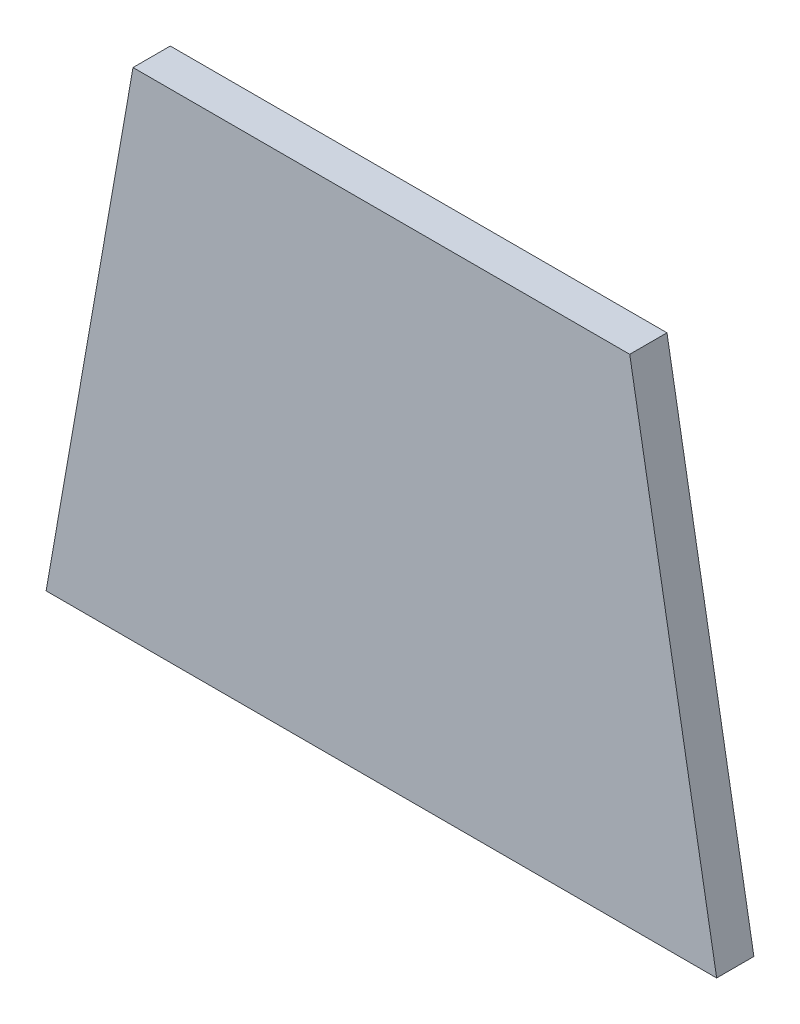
ISO-10303-21;
HEADER;
FILE_DESCRIPTION(('STEP AP214'),'2;1');
FILE_NAME('part.step','',(''),(''),'','','');
FILE_SCHEMA(('AUTOMOTIVE_DESIGN { 1 0 10303 214 1 1 1 1 }'));
ENDSEC;
DATA;
#1=APPLICATION_CONTEXT('core data for automotive mechanical design processes');
#2=APPLICATION_PROTOCOL_DEFINITION('international standard','automotive_design',2000,#1);
#3=PRODUCT_CONTEXT('',#1,'mechanical');
#4=PRODUCT('Part','Part','',(#3));
#5=PRODUCT_RELATED_PRODUCT_CATEGORY('part','',(#4));
#6=PRODUCT_DEFINITION_FORMATION('','',#4);
#7=PRODUCT_DEFINITION_CONTEXT('part definition',#1,'design');
#8=PRODUCT_DEFINITION('design','',#6,#7);
#9=PRODUCT_DEFINITION_SHAPE('','',#8);
#10=(LENGTH_UNIT() NAMED_UNIT(*) SI_UNIT(.MILLI.,.METRE.));
#11=(NAMED_UNIT(*) PLANE_ANGLE_UNIT() SI_UNIT($,.RADIAN.));
#12=(NAMED_UNIT(*) SI_UNIT($,.STERADIAN.) SOLID_ANGLE_UNIT());
#13=UNCERTAINTY_MEASURE_WITH_UNIT(LENGTH_MEASURE(1.E-05),#10,'distance_accuracy_value','');
#14=(GEOMETRIC_REPRESENTATION_CONTEXT(3) GLOBAL_UNCERTAINTY_ASSIGNED_CONTEXT((#13)) GLOBAL_UNIT_ASSIGNED_CONTEXT((#10,
#11,#12)) REPRESENTATION_CONTEXT('',''));
#15=CARTESIAN_POINT('',(0.,0.,0.));
#16=DIRECTION('',(0.,0.,1.));
#17=DIRECTION('',(1.,0.,0.));
#18=AXIS2_PLACEMENT_3D('',#15,#16,#17);
#19=CARTESIAN_POINT('',(-100.,200.,15.));
#20=DIRECTION('',(0.985030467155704,-0.172380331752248,0.));
#21=DIRECTION('',(0.172380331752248,0.985030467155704,0.));
#22=AXIS2_PLACEMENT_3D('',#19,#20,#21);
#23=PLANE('',#22);
#24=DIRECTION('',(-0.172380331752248,-0.985030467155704,0.));
#25=VECTOR('',#24,1.);
#26=CARTESIAN_POINT('',(-100.,200.,0.));
#27=LINE('',#26,#25);
#28=CARTESIAN_POINT('',(-100.,200.,0.));
#29=VERTEX_POINT('',#28);
#30=CARTESIAN_POINT('',(-135.,0.,0.));
#31=VERTEX_POINT('',#30);
#32=EDGE_CURVE('E105',#29,#31,#27,.T.);
#33=ORIENTED_EDGE('',*,*,#32,.T.);
#34=DIRECTION('',(0.,0.,-1.));
#35=VECTOR('',#34,1.);
#36=CARTESIAN_POINT('',(-135.,0.,15.));
#37=LINE('',#36,#35);
#38=CARTESIAN_POINT('',(-135.,0.,15.));
#39=VERTEX_POINT('',#38);
#40=EDGE_CURVE('E11',#39,#31,#37,.T.);
#41=ORIENTED_EDGE('',*,*,#40,.F.);
#42=DIRECTION('',(-0.172380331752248,-0.985030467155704,0.));
#43=VECTOR('',#42,1.);
#44=CARTESIAN_POINT('',(-100.,200.,15.));
#45=LINE('',#44,#43);
#46=CARTESIAN_POINT('',(-100.,200.,15.));
#47=VERTEX_POINT('',#46);
#48=EDGE_CURVE('E88',#47,#39,#45,.T.);
#49=ORIENTED_EDGE('',*,*,#48,.F.);
#50=DIRECTION('',(0.,0.,-1.));
#51=VECTOR('',#50,1.);
#52=CARTESIAN_POINT('',(-100.,200.,15.));
#53=LINE('',#52,#51);
#54=EDGE_CURVE('E101',#47,#29,#53,.T.);
#55=ORIENTED_EDGE('',*,*,#54,.T.);
#56=EDGE_LOOP('',(#33,#41,#49,#55));
#57=FACE_BOUND('',#56,.T.);
#58=ADVANCED_FACE('F36',(#57),#23,.F.);
#59=CARTESIAN_POINT('',(-135.,0.,15.));
#60=DIRECTION('',(0.,1.,0.));
#61=DIRECTION('',(0.,0.,1.));
#62=AXIS2_PLACEMENT_3D('',#59,#60,#61);
#63=PLANE('',#62);
#64=DIRECTION('',(1.,0.,0.));
#65=VECTOR('',#64,1.);
#66=CARTESIAN_POINT('',(-135.,0.,0.));
#67=LINE('',#66,#65);
#68=CARTESIAN_POINT('',(135.,0.,0.));
#69=VERTEX_POINT('',#68);
#70=EDGE_CURVE('E93',#31,#69,#67,.T.);
#71=ORIENTED_EDGE('',*,*,#70,.T.);
#72=DIRECTION('',(0.,0.,-1.));
#73=VECTOR('',#72,1.);
#74=CARTESIAN_POINT('',(135.,0.,15.));
#75=LINE('',#74,#73);
#76=CARTESIAN_POINT('',(135.,0.,15.));
#77=VERTEX_POINT('',#76);
#78=EDGE_CURVE('E45',#77,#69,#75,.T.);
#79=ORIENTED_EDGE('',*,*,#78,.F.);
#80=DIRECTION('',(1.,0.,0.));
#81=VECTOR('',#80,1.);
#82=CARTESIAN_POINT('',(-135.,0.,15.));
#83=LINE('',#82,#81);
#84=EDGE_CURVE('E83',#39,#77,#83,.T.);
#85=ORIENTED_EDGE('',*,*,#84,.F.);
#86=ORIENTED_EDGE('',*,*,#40,.T.);
#87=EDGE_LOOP('',(#71,#79,#85,#86));
#88=FACE_BOUND('',#87,.T.);
#89=ADVANCED_FACE('F92',(#88),#63,.F.);
#90=CARTESIAN_POINT('',(135.,0.,15.));
#91=DIRECTION('',(-0.985030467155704,-0.172380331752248,0.));
#92=DIRECTION('',(0.172380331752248,-0.985030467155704,0.));
#93=AXIS2_PLACEMENT_3D('',#90,#91,#92);
#94=PLANE('',#93);
#95=DIRECTION('',(-0.172380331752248,0.985030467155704,0.));
#96=VECTOR('',#95,1.);
#97=CARTESIAN_POINT('',(135.,0.,0.));
#98=LINE('',#97,#96);
#99=CARTESIAN_POINT('',(100.,200.,0.));
#100=VERTEX_POINT('',#99);
#101=EDGE_CURVE('E70',#69,#100,#98,.T.);
#102=ORIENTED_EDGE('',*,*,#101,.T.);
#103=DIRECTION('',(0.,0.,-1.));
#104=VECTOR('',#103,1.);
#105=CARTESIAN_POINT('',(100.,200.,15.));
#106=LINE('',#105,#104);
#107=CARTESIAN_POINT('',(100.,200.,15.));
#108=VERTEX_POINT('',#107);
#109=EDGE_CURVE('E95',#108,#100,#106,.T.);
#110=ORIENTED_EDGE('',*,*,#109,.F.);
#111=DIRECTION('',(-0.172380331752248,0.985030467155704,0.));
#112=VECTOR('',#111,1.);
#113=CARTESIAN_POINT('',(135.,0.,15.));
#114=LINE('',#113,#112);
#115=EDGE_CURVE('E86',#77,#108,#114,.T.);
#116=ORIENTED_EDGE('',*,*,#115,.F.);
#117=ORIENTED_EDGE('',*,*,#78,.T.);
#118=EDGE_LOOP('',(#102,#110,#116,#117));
#119=FACE_BOUND('',#118,.T.);
#120=ADVANCED_FACE('F96',(#119),#94,.F.);
#121=CARTESIAN_POINT('',(100.,200.,15.));
#122=DIRECTION('',(0.,-1.,0.));
#123=DIRECTION('',(0.,0.,-1.));
#124=AXIS2_PLACEMENT_3D('',#121,#122,#123);
#125=PLANE('',#124);
#126=DIRECTION('',(-1.,0.,0.));
#127=VECTOR('',#126,1.);
#128=CARTESIAN_POINT('',(100.,200.,0.));
#129=LINE('',#128,#127);
#130=EDGE_CURVE('E76',#100,#29,#129,.T.);
#131=ORIENTED_EDGE('',*,*,#130,.T.);
#132=ORIENTED_EDGE('',*,*,#54,.F.);
#133=DIRECTION('',(-1.,0.,0.));
#134=VECTOR('',#133,1.);
#135=CARTESIAN_POINT('',(100.,200.,15.));
#136=LINE('',#135,#134);
#137=EDGE_CURVE('E53',#108,#47,#136,.T.);
#138=ORIENTED_EDGE('',*,*,#137,.F.);
#139=ORIENTED_EDGE('',*,*,#109,.T.);
#140=EDGE_LOOP('',(#131,#132,#138,#139));
#141=FACE_BOUND('',#140,.T.);
#142=ADVANCED_FACE('F119',(#141),#125,.F.);
#143=CARTESIAN_POINT('',(0.,0.,15.));
#144=DIRECTION('',(0.,0.,1.));
#145=DIRECTION('',(1.,0.,0.));
#146=AXIS2_PLACEMENT_3D('',#143,#144,#145);
#147=PLANE('',#146);
#148=ORIENTED_EDGE('',*,*,#48,.T.);
#149=ORIENTED_EDGE('',*,*,#84,.T.);
#150=ORIENTED_EDGE('',*,*,#115,.T.);
#151=ORIENTED_EDGE('',*,*,#137,.T.);
#152=EDGE_LOOP('',(#148,#149,#150,#151));
#153=FACE_BOUND('',#152,.T.);
#154=ADVANCED_FACE('F84',(#153),#147,.T.);
#155=CARTESIAN_POINT('',(0.,0.,0.));
#156=DIRECTION('',(0.,0.,1.));
#157=DIRECTION('',(1.,0.,0.));
#158=AXIS2_PLACEMENT_3D('',#155,#156,#157);
#159=PLANE('',#158);
#160=ORIENTED_EDGE('',*,*,#32,.F.);
#161=ORIENTED_EDGE('',*,*,#130,.F.);
#162=ORIENTED_EDGE('',*,*,#101,.F.);
#163=ORIENTED_EDGE('',*,*,#70,.F.);
#164=EDGE_LOOP('',(#160,#161,#162,#163));
#165=FACE_BOUND('',#164,.T.);
#166=ADVANCED_FACE('F122',(#165),#159,.F.);
#167=CLOSED_SHELL('',(#58,#89,#120,#142,#154,#166));
#168=MANIFOLD_SOLID_BREP('B2',#167);
#169=ADVANCED_BREP_SHAPE_REPRESENTATION('',(#18,#168),#14);
#170=SHAPE_DEFINITION_REPRESENTATION(#9,#169);
ENDSEC;
END-ISO-10303-21;
